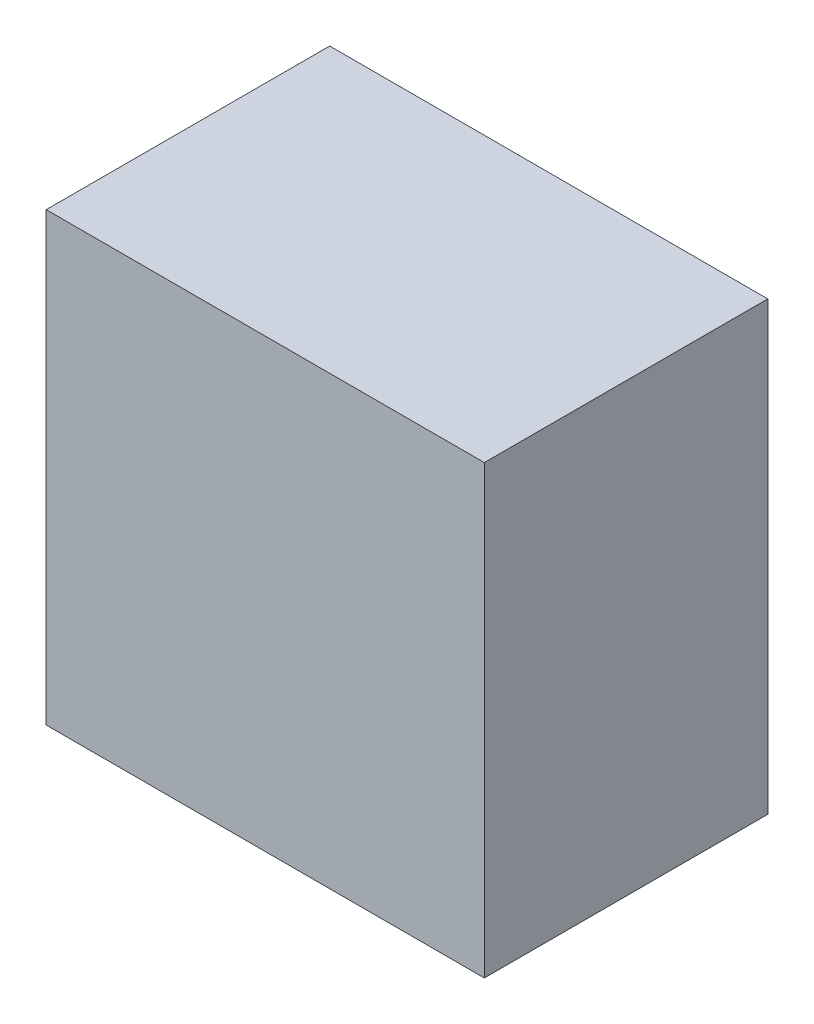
from build123d import *

# Parameters (mm, degrees)
SKETCH1_W      = 78.509090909
SKETCH1_H      = 79.99600551
EXTRUDE1_DEPTH = 50.8


with BuildPart() as part:
    # Sketch1 → Extrude1 (new body)
    with BuildSketch(Plane.XY):
        with Locations((39.254545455, 39.998002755)):
            Rectangle(SKETCH1_W, SKETCH1_H)
    extrude(amount=EXTRUDE1_DEPTH)


solid = part.part
